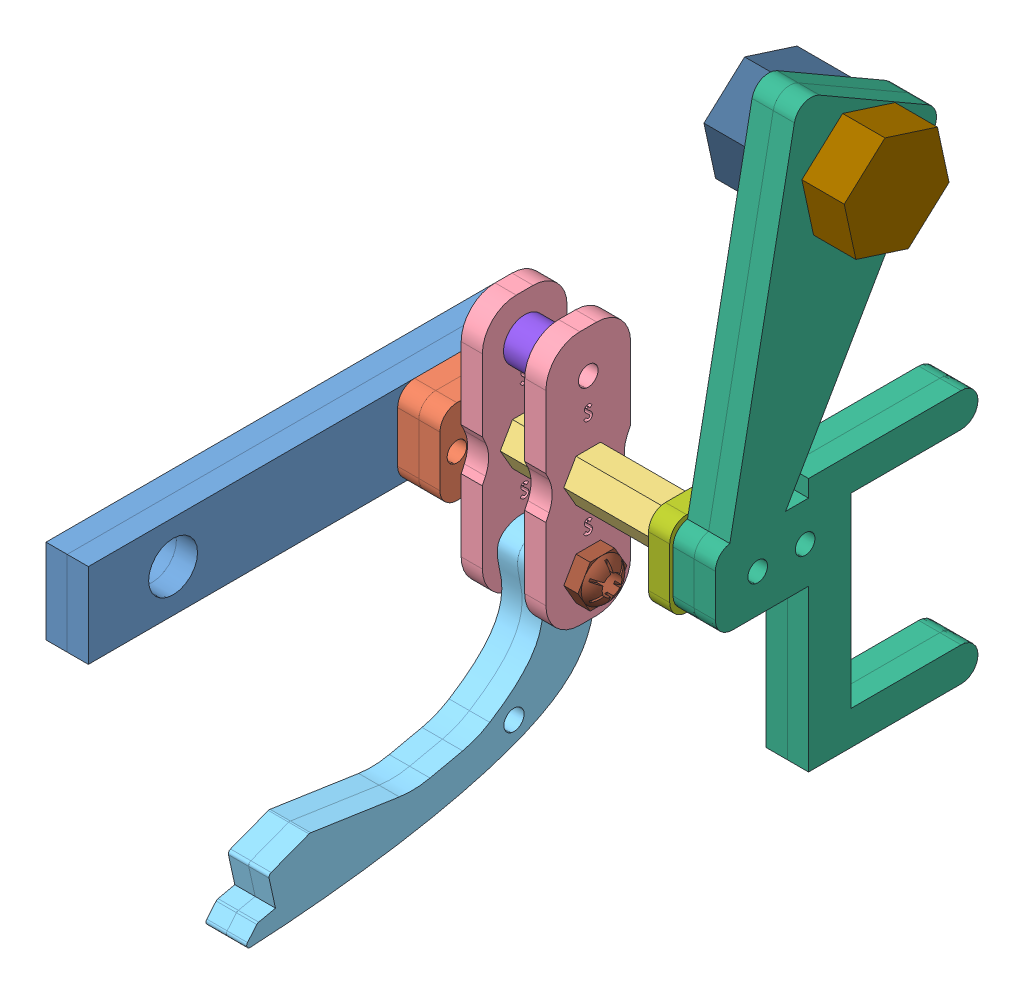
SolidWorks assembly Sautoir.SLDASM, configuration Default (file format 7000). Lengths in mm.
Overall size (57.15 100.16 88.9).
16 component instances, 11 part files, 32 mates.
Components (placement in the parent):
- SautoirMount-1: SautoirMount.SLDPRT [SautoirMountA] at (12.2439 19.1483 75.6794) size (3.17 12.7 68.58)
- SautoirMount-2: SautoirMount.SLDPRT [SautoirMountB] at (15.4189 19.1483 75.6794) size (3.17 12.7 68.58)
- SautoirMountC2-3: SautoirMountC2.SLDPRT [Default] at (18.5939 19.1483 29.3244) x (0 0 1) z (-1 0 0) size (19.05 12.7 3.17)
- SautoirMountC2-2: SautoirMountC2.SLDPRT [Default] at (21.7689 19.1483 29.3244) x (0 0 1) z (-1 0 0) size (19.05 12.7 3.17)
- Standoff-1p75in-1s4-1: Standoff-1p75in-1s4.SLDPRT [Default] at (59.8689 25.4983 19.7994) x (0 0.866025 0.5) z (0 -0.5 0.866025) size (7.33 44.45 6.35)
- SautoirArm-1: SautoirArm.SLDPRT [Default] at (24.9439 6.4483 26.1494) x (0 0 -1) z (1 0 0) size (12.7 38.1 3.17)
- SautoirArm-2: SautoirArm.SLDPRT [Default] at (34.4689 6.4483 26.1494) x (0 0 -1) z (1 0 0) size (12.7 38.1 3.17)
- CarryPawl-4: CarryPawl.SLDPRT [Default] at (28.1189 -18.4346 33.7088) x (0 0.213886 -0.976859) z (1 0 0) size (55.75 22.21 3.05)
- CarryPawl-3: CarryPawl.SLDPRT [Default] at (31.1669 -18.4346 33.7088) x (0 0.213886 -0.976859) z (1 0 0) size (55.75 22.21 3.05)
- CarryLever-2: CarryLever.SLDPRT [CarryLeverB] at (56.6939 19.7833 26.1494) x (0 0 -1) z (1 0 0) size (39.37 87.39 3.17)
- CarryLever-3: CarryLever.SLDPRT [CarryLeverA] at (59.8689 19.7833 26.1494) x (0 0 -1) z (1 0 0) size (39.37 87.39 3.17)
- SautoirMountC-3: SautoirMountC.SLDPRT [Default] at (53.5189 31.8483 9.4956) x (0 0 -1) z (-1 0 0) size (17.14 12.7 3.17)
- Spacer-0p25-1s4-1: Spacer-0p25-1s4.SLDPRT [Default] at (28.1189 38.1983 19.7994) x (0 0 -1) z (1 0 0) size (6.35 6.35 6.35)
- Bolt-3s8-0p625-1: Bolt-3s8-0p625.SLDPRT [Default] at (63.0439 70.5305 5.3227) x (1 0 0) z (0 -0.672316 0.740264) size (22.23 14.29 16.5)
- Nut-3s8-1: Nut-3s8.SLDPRT [Default] at (48.3595 70.5305 5.3227) x (1 0 0) z (0 -0.672316 0.740264) size (8.33 14.29 16.5)
- Locknut-1: Locknut.SLDPRT [Default] at (39.7648 12.7983 19.7994) x (0 0 1) z (-1 0 0) size (7.33 6.35 3.56)
Mates (geometry in assembly coordinates):
- Coincident9: coincident aligned: line of SautoirMount-1 through (15.4189 31.8483 7.0994) axis (0 0 1); line of SautoirMount-2 through (15.4189 31.8483 7.0994) axis (0 0 1)
- Coincident10: coincident aligned: line of SautoirMount-1 through (15.4189 19.1483 7.0994) axis (0 1 0); line of SautoirMount-2 through (15.4189 19.1483 7.0994) axis (0 1 0)
- Coincident14: coincident anti-aligned: plane of Standoff-1p75in-1s4-1 through (15.4189 25.4983 19.7994) normal (-1 0 0); plane of SautoirMount-1 through (15.4189 19.1483 75.6794) normal (1 0 0)
- Coincident30: coincident anti-aligned: plane of CarryPawl-4 through (31.1669 4.4081 15.5449) normal (1 0 0); plane of CarryPawl-3 through (31.1669 4.4081 15.5449) normal (-1 0 0)
- Concentric6: concentric aligned: circle of CarryPawl-4; circle of CarryPawl-3
- Concentric7: concentric aligned: circle of CarryPawl-4; circle of CarryPawl-3
- Concentric11: concentric anti-aligned: circle of Bolt-3s8-0p625-1; circle of Nut-3s8-1
- Concentric13: concentric anti-aligned: circle of CarryLever-3; circle of Bolt-3s8-0p625-1
- Coincident39: coincident anti-aligned: plane of CarryLever-3 through (63.0439 31.2133 -10.6806) normal (1 0 0); plane of Bolt-3s8-0p625-1 through (63.0439 70.5305 5.3227) normal (-1 0 0)
- Coincident40: coincident anti-aligned: plane of CarryLever-2 through (56.6939 31.2133 -10.6806) normal (-1 0 0); plane of Nut-3s8-1 through (56.6939 70.5305 5.3227) normal (1 0 0)
- Coincident44: coincident anti-aligned: plane of Standoff-1p75in-1s4-1 through (15.4189 28.6733 21.6325) normal (0 1 0); plane of SautoirMountC2-3 through (21.7689 28.6733 17.9663) normal (0 -1 0)
- Coincident45: coincident aligned: circle of SautoirMount-2; circle of SautoirMountC2-3
- Coincident46: coincident anti-aligned: plane of Standoff-1p75in-1s4-1 through (15.4189 28.6733 21.6325) normal (0 1 0); plane of SautoirMountC2-2 through (24.9439 28.6733 17.9663) normal (0 -1 0)
- Coincident47: coincident aligned: circle of SautoirMountC2-3; circle of SautoirMountC2-2
- Coincident61: coincident anti-aligned: circle of SautoirArm-2; circle of Spacer-0p25-1s4-1
- Coincident62: coincident anti-aligned: circle of SautoirArm-1; circle of Spacer-0p25-1s4-1
- Coincident63: coincident anti-aligned: plane of Standoff-1p75in-1s4-1 through (15.4189 28.6733 21.6325) normal (0 1 0); plane of SautoirArm-1 through (28.1189 28.6733 17.9663) normal (0 -1 0)
- Coincident64: coincident anti-aligned: plane of Standoff-1p75in-1s4-1 through (15.4189 25.4983 23.4656) normal (0 0.5 0.866025); plane of SautoirArm-1 through (28.1189 28.6733 21.6325) normal (0 -0.5 -0.866025)
- Concentric16: concentric anti-aligned: circle of SautoirArm-1; circle of CarryPawl-4
- Coincident65: coincident anti-aligned: plane of SautoirArm-1 through (28.1189 6.4483 26.1494) normal (1 0 0); plane of CarryPawl-4 through (28.1189 4.4081 15.5449) normal (-1 0 0)
- Concentric17: concentric anti-aligned: circle of SautoirArm-2; circle of CarryPawl-3
- Coincident66: coincident anti-aligned: plane of SautoirArm-1 through (24.9439 6.4483 26.1494) normal (-1 0 0); plane of SautoirMountC2-2 through (24.9439 19.1483 29.3244) normal (1 0 0)
- Coincident72: coincident aligned: circle of SautoirArm-2; circle of Locknut-1
- Coincident75: coincident aligned: circle of CarryLever-2; circle of CarryLever-3
- Coincident76: coincident aligned: line of SautoirMount-2 through (18.5939 28.6733 17.9663) axis (0 0 1); line of SautoirMountC2-3 through (18.5939 28.6733 17.9663) axis (0 0 1)
- Concentric18: concentric anti-aligned: circle of SautoirMount-1; circle of Standoff-1p75in-1s4-1
- Coincident77: coincident anti-aligned: plane of Standoff-1p75in-1s4-1 through (15.4189 28.6733 21.6325) normal (0 1 0); plane of SautoirMountC-3 through (56.6939 28.6733 17.9663) normal (0 -1 0)
- Coincident78: coincident anti-aligned: plane of CarryLever-2 through (56.6939 31.2133 -10.6806) normal (-1 0 0); plane of SautoirMountC-3 through (56.6939 31.8483 9.4956) normal (1 0 0)
- Concentric19: concentric aligned: circle of CarryLever-2; circle of SautoirMountC-3
- Coincident79: coincident aligned: circle of CarryLever-2; circle of CarryLever-3
- Concentric20: concentric anti-aligned: circle of Standoff-1p75in-1s4-1; circle of CarryLever-3
- Coincident80: coincident anti-aligned: plane of Standoff-1p75in-1s4-1 through (59.8689 25.4983 19.7994) normal (1 0 0); plane of CarryLever-3 through (59.8689 31.2133 -10.6806) normal (-1 0 0)
